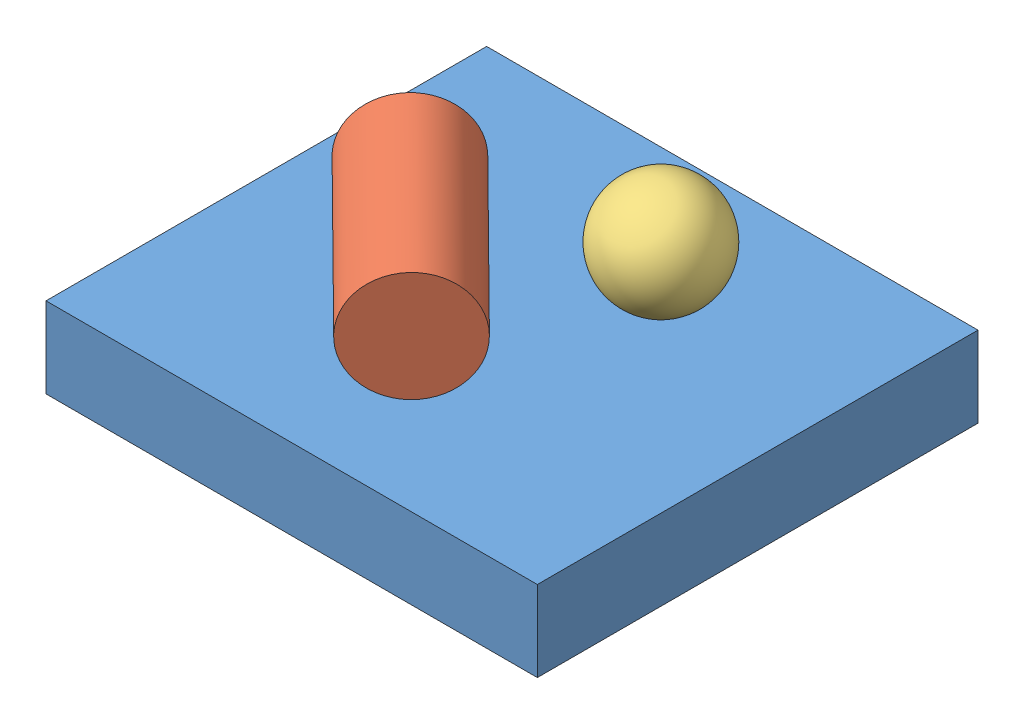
SolidWorks assembly Tangent.SLDASM, configuration Default (file format 4628). Lengths in mm.
Overall size (226.59 97.53 203.2).
3 component instances, 3 part files, 2 mates.
Components (placement in the parent):
- Simple Plate-1: Simple Plate.SLDPRT [Default] at origin size (226.59 37.18 203.2)
- Cylinder-1: Cylinder.SLDPRT [Default] at (51.5366 62.5789 86.9433) x (-0.369464 0.850926 0.373391) z (0.710835 0 0.703359) size (50.8 50.8 101.6)
- Sphere-1: Sphere.SLDPRT [Default] at (143.6739 62.5789 63.3097) x (0.432294 -0.142624 -0.890382) z (0.896986 0.169199 0.408397) size (50.8 50.8 50.8)
Mates (geometry in assembly coordinates):
- Tangent1: tangent anti-aligned: plane of Simple Plate-1 through (0 37.1789 203.2) normal (0 1 0); cylinder of Cylinder-1 through (123.7574 62.5789 158.4046) axis (-0.710835 0 -0.703359) radius 25.4
- Tangent2: tangent anti-aligned: plane of Simple Plate-1 through (0 37.1789 203.2) normal (0 1 0); sphere of Sphere-1
